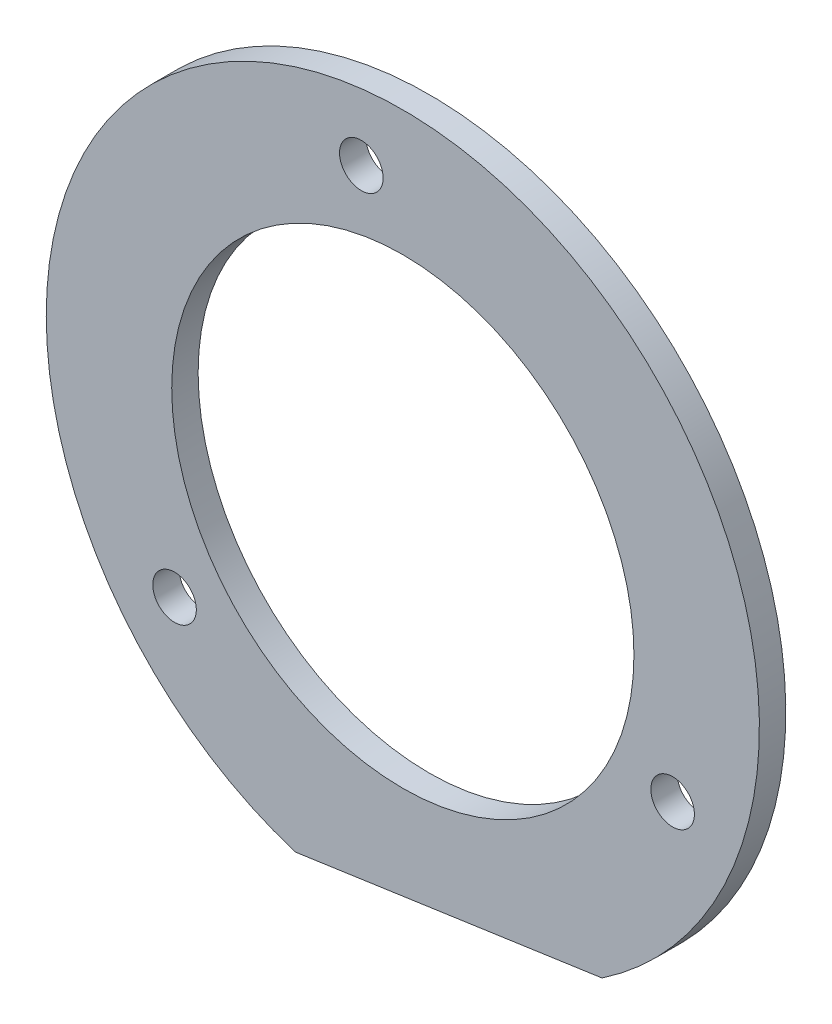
ISO-10303-21;
HEADER;
FILE_DESCRIPTION(('STEP AP214'),'2;1');
FILE_NAME('part.step','',(''),(''),'','','');
FILE_SCHEMA(('AUTOMOTIVE_DESIGN { 1 0 10303 214 1 1 1 1 }'));
ENDSEC;
DATA;
#1=APPLICATION_CONTEXT('core data for automotive mechanical design processes');
#2=APPLICATION_PROTOCOL_DEFINITION('international standard','automotive_design',2000,#1);
#3=PRODUCT_CONTEXT('',#1,'mechanical');
#4=PRODUCT('Part','Part','',(#3));
#5=PRODUCT_RELATED_PRODUCT_CATEGORY('part','',(#4));
#6=PRODUCT_DEFINITION_FORMATION('','',#4);
#7=PRODUCT_DEFINITION_CONTEXT('part definition',#1,'design');
#8=PRODUCT_DEFINITION('design','',#6,#7);
#9=PRODUCT_DEFINITION_SHAPE('','',#8);
#10=(LENGTH_UNIT() NAMED_UNIT(*) SI_UNIT(.MILLI.,.METRE.));
#11=(NAMED_UNIT(*) PLANE_ANGLE_UNIT() SI_UNIT($,.RADIAN.));
#12=(NAMED_UNIT(*) SI_UNIT($,.STERADIAN.) SOLID_ANGLE_UNIT());
#13=UNCERTAINTY_MEASURE_WITH_UNIT(LENGTH_MEASURE(1.E-05),#10,'distance_accuracy_value','');
#14=(GEOMETRIC_REPRESENTATION_CONTEXT(3) GLOBAL_UNCERTAINTY_ASSIGNED_CONTEXT((#13)) GLOBAL_UNIT_ASSIGNED_CONTEXT((#10,
#11,#12)) REPRESENTATION_CONTEXT('',''));
#15=CARTESIAN_POINT('',(0.,0.,0.));
#16=DIRECTION('',(0.,0.,1.));
#17=DIRECTION('',(1.,0.,0.));
#18=AXIS2_PLACEMENT_3D('',#15,#16,#17);
#19=CARTESIAN_POINT('',(0.,0.,-8.00000000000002));
#20=DIRECTION('',(0.,0.,-1.));
#21=DIRECTION('',(-1.,0.,0.));
#22=AXIS2_PLACEMENT_3D('',#19,#20,#21);
#23=PLANE('',#22);
#24=CARTESIAN_POINT('',(20.4285811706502,-8.16535800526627,-8.00000000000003));
#25=DIRECTION('',(0.,0.,-1.));
#26=DIRECTION('',(-1.,0.,0.));
#27=AXIS2_PLACEMENT_3D('',#24,#25,#26);
#28=CIRCLE('',#27,1.64999999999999);
#29=CARTESIAN_POINT('',(18.7785811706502,-8.16535800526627,-8.00000000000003));
#30=VERTEX_POINT('',#29);
#31=EDGE_CURVE('E93',#30,#30,#28,.T.);
#32=ORIENTED_EDGE('',*,*,#31,.F.);
#33=EDGE_LOOP('',(#32));
#34=FACE_BOUND('',#33,.T.);
#35=CARTESIAN_POINT('',(-17.28569804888,-13.6089912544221,-8.00000000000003));
#36=DIRECTION('',(0.,0.,-1.));
#37=DIRECTION('',(-1.,0.,0.));
#38=AXIS2_PLACEMENT_3D('',#35,#36,#37);
#39=CIRCLE('',#38,1.64999999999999);
#40=CARTESIAN_POINT('',(-18.93569804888,-13.6089912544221,-8.00000000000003));
#41=VERTEX_POINT('',#40);
#42=EDGE_CURVE('E87',#41,#41,#39,.T.);
#43=ORIENTED_EDGE('',*,*,#42,.F.);
#44=EDGE_LOOP('',(#43));
#45=FACE_BOUND('',#44,.T.);
#46=CARTESIAN_POINT('',(-3.14288312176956,21.7743492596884,-8.00000000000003));
#47=DIRECTION('',(0.,0.,-1.));
#48=DIRECTION('',(-1.,0.,0.));
#49=AXIS2_PLACEMENT_3D('',#46,#47,#48);
#50=CIRCLE('',#49,1.64999999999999);
#51=CARTESIAN_POINT('',(-4.79288312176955,21.7743492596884,-8.00000000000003));
#52=VERTEX_POINT('',#51);
#53=EDGE_CURVE('E81',#52,#52,#50,.T.);
#54=ORIENTED_EDGE('',*,*,#53,.F.);
#55=EDGE_LOOP('',(#54));
#56=FACE_BOUND('',#55,.T.);
#57=CARTESIAN_POINT('',(0.,0.,-8.00000000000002));
#58=DIRECTION('',(0.,0.,-1.));
#59=DIRECTION('',(-1.,0.,0.));
#60=AXIS2_PLACEMENT_3D('',#57,#58,#59);
#61=CIRCLE('',#60,27.);
#62=CARTESIAN_POINT('',(-8.13531021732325,-25.7452272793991,-8.00000000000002));
#63=VERTEX_POINT('',#62);
#64=CARTESIAN_POINT('',(15.0836435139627,-22.3938317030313,-8.00000000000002));
#65=VERTEX_POINT('',#64);
#66=EDGE_CURVE('E62',#63,#65,#61,.T.);
#67=ORIENTED_EDGE('',*,*,#66,.T.);
#68=DIRECTION('',(-0.989743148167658,-0.142858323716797,0.));
#69=VECTOR('',#68,1.);
#70=CARTESIAN_POINT('',(15.0836435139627,-22.3938317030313,-8.00000000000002));
#71=LINE('',#70,#69);
#72=EDGE_CURVE('E47',#65,#63,#71,.T.);
#73=ORIENTED_EDGE('',*,*,#72,.T.);
#74=EDGE_LOOP('',(#67,#73));
#75=FACE_BOUND('',#74,.T.);
#76=CARTESIAN_POINT('',(0.,0.,-8.00000000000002));
#77=DIRECTION('',(0.,0.,-1.));
#78=DIRECTION('',(-1.,0.,0.));
#79=AXIS2_PLACEMENT_3D('',#76,#77,#78);
#80=CIRCLE('',#79,17.5);
#81=CARTESIAN_POINT('',(-17.5,0.,-8.00000000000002));
#82=VERTEX_POINT('',#81);
#83=EDGE_CURVE('E68',#82,#82,#80,.T.);
#84=ORIENTED_EDGE('',*,*,#83,.F.);
#85=EDGE_LOOP('',(#84));
#86=FACE_BOUND('',#85,.T.);
#87=ADVANCED_FACE('F31',(#34,#45,#56,#75,#86),#23,.T.);
#88=CARTESIAN_POINT('',(0.,0.,-6.00000000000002));
#89=DIRECTION('',(0.,0.,-1.));
#90=DIRECTION('',(-1.,0.,0.));
#91=AXIS2_PLACEMENT_3D('',#88,#89,#90);
#92=PLANE('',#91);
#93=CARTESIAN_POINT('',(20.4285811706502,-8.16535800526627,-6.00000000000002));
#94=DIRECTION('',(0.,0.,-1.));
#95=DIRECTION('',(-1.,0.,0.));
#96=AXIS2_PLACEMENT_3D('',#93,#94,#95);
#97=CIRCLE('',#96,1.65);
#98=CARTESIAN_POINT('',(18.7785811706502,-8.16535800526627,-6.00000000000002));
#99=VERTEX_POINT('',#98);
#100=EDGE_CURVE('E90',#99,#99,#97,.T.);
#101=ORIENTED_EDGE('',*,*,#100,.T.);
#102=EDGE_LOOP('',(#101));
#103=FACE_BOUND('',#102,.T.);
#104=CARTESIAN_POINT('',(-17.28569804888,-13.6089912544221,-6.00000000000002));
#105=DIRECTION('',(0.,0.,-1.));
#106=DIRECTION('',(-1.,0.,0.));
#107=AXIS2_PLACEMENT_3D('',#104,#105,#106);
#108=CIRCLE('',#107,1.65);
#109=CARTESIAN_POINT('',(-18.93569804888,-13.6089912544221,-6.00000000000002));
#110=VERTEX_POINT('',#109);
#111=EDGE_CURVE('E84',#110,#110,#108,.T.);
#112=ORIENTED_EDGE('',*,*,#111,.T.);
#113=EDGE_LOOP('',(#112));
#114=FACE_BOUND('',#113,.T.);
#115=CARTESIAN_POINT('',(-3.14288312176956,21.7743492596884,-6.00000000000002));
#116=DIRECTION('',(0.,0.,-1.));
#117=DIRECTION('',(-1.,0.,0.));
#118=AXIS2_PLACEMENT_3D('',#115,#116,#117);
#119=CIRCLE('',#118,1.65);
#120=CARTESIAN_POINT('',(-4.79288312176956,21.7743492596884,-6.00000000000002));
#121=VERTEX_POINT('',#120);
#122=EDGE_CURVE('E77',#121,#121,#119,.T.);
#123=ORIENTED_EDGE('',*,*,#122,.T.);
#124=EDGE_LOOP('',(#123));
#125=FACE_BOUND('',#124,.T.);
#126=CARTESIAN_POINT('',(0.,0.,-6.00000000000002));
#127=DIRECTION('',(0.,0.,-1.));
#128=DIRECTION('',(-1.,0.,0.));
#129=AXIS2_PLACEMENT_3D('',#126,#127,#128);
#130=CIRCLE('',#129,27.);
#131=CARTESIAN_POINT('',(-8.13531021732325,-25.7452272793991,-6.00000000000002));
#132=VERTEX_POINT('',#131);
#133=CARTESIAN_POINT('',(15.0836435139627,-22.3938317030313,-6.00000000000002));
#134=VERTEX_POINT('',#133);
#135=EDGE_CURVE('E63',#132,#134,#130,.T.);
#136=ORIENTED_EDGE('',*,*,#135,.F.);
#137=DIRECTION('',(-0.989743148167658,-0.142858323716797,0.));
#138=VECTOR('',#137,1.);
#139=CARTESIAN_POINT('',(15.0836435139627,-22.3938317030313,-6.00000000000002));
#140=LINE('',#139,#138);
#141=EDGE_CURVE('E55',#134,#132,#140,.T.);
#142=ORIENTED_EDGE('',*,*,#141,.F.);
#143=EDGE_LOOP('',(#136,#142));
#144=FACE_BOUND('',#143,.T.);
#145=CARTESIAN_POINT('',(0.,0.,-6.00000000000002));
#146=DIRECTION('',(0.,0.,-1.));
#147=DIRECTION('',(-1.,0.,0.));
#148=AXIS2_PLACEMENT_3D('',#145,#146,#147);
#149=CIRCLE('',#148,17.5);
#150=CARTESIAN_POINT('',(-17.5,0.,-6.00000000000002));
#151=VERTEX_POINT('',#150);
#152=EDGE_CURVE('E71',#151,#151,#149,.T.);
#153=ORIENTED_EDGE('',*,*,#152,.T.);
#154=EDGE_LOOP('',(#153));
#155=FACE_BOUND('',#154,.T.);
#156=ADVANCED_FACE('F66',(#103,#114,#125,#144,#155),#92,.F.);
#157=CARTESIAN_POINT('',(0.,0.,-8.00000000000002));
#158=DIRECTION('',(0.,0.,1.));
#159=DIRECTION('',(1.,0.,0.));
#160=AXIS2_PLACEMENT_3D('',#157,#158,#159);
#161=CYLINDRICAL_SURFACE('',#160,27.);
#162=ORIENTED_EDGE('',*,*,#135,.T.);
#163=DIRECTION('',(0.,0.,1.));
#164=VECTOR('',#163,1.);
#165=CARTESIAN_POINT('',(15.0836435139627,-22.3938317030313,-8.00000000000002));
#166=LINE('',#165,#164);
#167=EDGE_CURVE('E11',#65,#134,#166,.T.);
#168=ORIENTED_EDGE('',*,*,#167,.F.);
#169=ORIENTED_EDGE('',*,*,#66,.F.);
#170=DIRECTION('',(0.,0.,1.));
#171=VECTOR('',#170,1.);
#172=CARTESIAN_POINT('',(-8.13531021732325,-25.7452272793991,-8.00000000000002));
#173=LINE('',#172,#171);
#174=EDGE_CURVE('E40',#63,#132,#173,.T.);
#175=ORIENTED_EDGE('',*,*,#174,.T.);
#176=EDGE_LOOP('',(#162,#168,#169,#175));
#177=FACE_BOUND('',#176,.T.);
#178=ADVANCED_FACE('F33',(#177),#161,.T.);
#179=CARTESIAN_POINT('',(15.0836435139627,-22.3938317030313,-8.00000000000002));
#180=DIRECTION('',(-0.142858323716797,0.989743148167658,0.));
#181=DIRECTION('',(-0.989743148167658,-0.142858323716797,0.));
#182=AXIS2_PLACEMENT_3D('',#179,#180,#181);
#183=PLANE('',#182);
#184=ORIENTED_EDGE('',*,*,#141,.T.);
#185=ORIENTED_EDGE('',*,*,#174,.F.);
#186=ORIENTED_EDGE('',*,*,#72,.F.);
#187=ORIENTED_EDGE('',*,*,#167,.T.);
#188=EDGE_LOOP('',(#184,#185,#186,#187));
#189=FACE_BOUND('',#188,.T.);
#190=ADVANCED_FACE('F58',(#189),#183,.F.);
#191=CARTESIAN_POINT('',(0.,0.,-8.00000000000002));
#192=DIRECTION('',(0.,0.,1.));
#193=DIRECTION('',(1.,0.,0.));
#194=AXIS2_PLACEMENT_3D('',#191,#192,#193);
#195=CYLINDRICAL_SURFACE('',#194,17.5);
#196=ORIENTED_EDGE('',*,*,#83,.T.);
#197=EDGE_LOOP('',(#196));
#198=FACE_BOUND('',#197,.T.);
#199=ORIENTED_EDGE('',*,*,#152,.F.);
#200=EDGE_LOOP('',(#199));
#201=FACE_BOUND('',#200,.T.);
#202=ADVANCED_FACE('F108',(#198,#201),#195,.F.);
#203=CARTESIAN_POINT('',(-3.14288312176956,21.7743492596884,-8.00000000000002));
#204=DIRECTION('',(0.,0.,-1.));
#205=DIRECTION('',(-1.,0.,0.));
#206=AXIS2_PLACEMENT_3D('',#203,#204,#205);
#207=CYLINDRICAL_SURFACE('',#206,1.64999999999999);
#208=ORIENTED_EDGE('',*,*,#122,.F.);
#209=EDGE_LOOP('',(#208));
#210=FACE_BOUND('',#209,.T.);
#211=ORIENTED_EDGE('',*,*,#53,.T.);
#212=EDGE_LOOP('',(#211));
#213=FACE_BOUND('',#212,.T.);
#214=ADVANCED_FACE('F111',(#210,#213),#207,.F.);
#215=CARTESIAN_POINT('',(-17.28569804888,-13.6089912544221,-8.00000000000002));
#216=DIRECTION('',(0.,0.,-1.));
#217=DIRECTION('',(-1.,0.,0.));
#218=AXIS2_PLACEMENT_3D('',#215,#216,#217);
#219=CYLINDRICAL_SURFACE('',#218,1.64999999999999);
#220=ORIENTED_EDGE('',*,*,#111,.F.);
#221=EDGE_LOOP('',(#220));
#222=FACE_BOUND('',#221,.T.);
#223=ORIENTED_EDGE('',*,*,#42,.T.);
#224=EDGE_LOOP('',(#223));
#225=FACE_BOUND('',#224,.T.);
#226=ADVANCED_FACE('F137',(#222,#225),#219,.F.);
#227=CARTESIAN_POINT('',(20.4285811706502,-8.16535800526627,-8.00000000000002));
#228=DIRECTION('',(0.,0.,-1.));
#229=DIRECTION('',(-1.,0.,0.));
#230=AXIS2_PLACEMENT_3D('',#227,#228,#229);
#231=CYLINDRICAL_SURFACE('',#230,1.64999999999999);
#232=ORIENTED_EDGE('',*,*,#100,.F.);
#233=EDGE_LOOP('',(#232));
#234=FACE_BOUND('',#233,.T.);
#235=ORIENTED_EDGE('',*,*,#31,.T.);
#236=EDGE_LOOP('',(#235));
#237=FACE_BOUND('',#236,.T.);
#238=ADVANCED_FACE('F97',(#234,#237),#231,.F.);
#239=CLOSED_SHELL('',(#87,#156,#178,#190,#202,#214,#226,#238));
#240=MANIFOLD_SOLID_BREP('B2',#239);
#241=ADVANCED_BREP_SHAPE_REPRESENTATION('',(#18,#240),#14);
#242=SHAPE_DEFINITION_REPRESENTATION(#9,#241);
ENDSEC;
END-ISO-10303-21;
